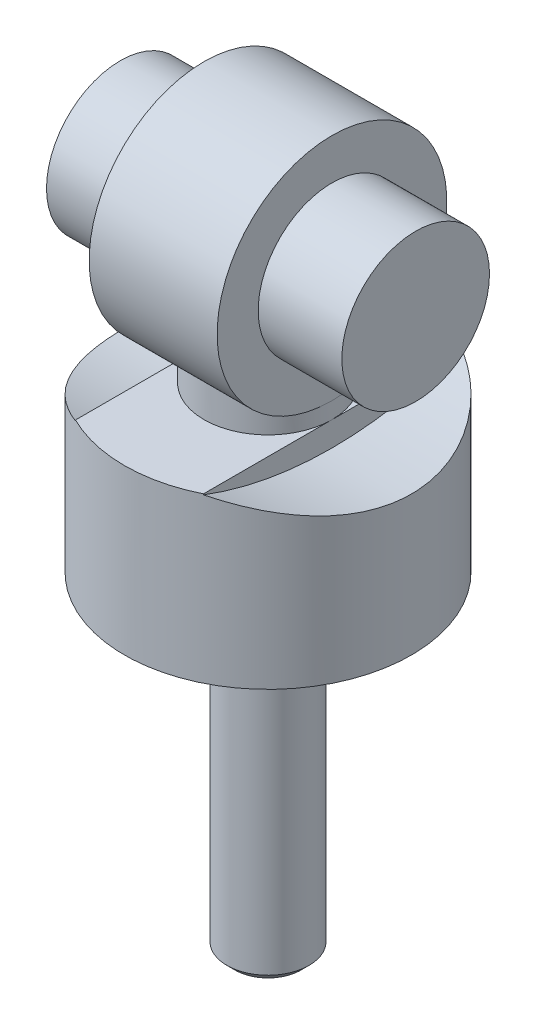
ISO-10303-21;
HEADER;
FILE_DESCRIPTION(('STEP AP214'),'2;1');
FILE_NAME('part.step','',(''),(''),'','','');
FILE_SCHEMA(('AUTOMOTIVE_DESIGN { 1 0 10303 214 1 1 1 1 }'));
ENDSEC;
DATA;
#1=APPLICATION_CONTEXT('core data for automotive mechanical design processes');
#2=APPLICATION_PROTOCOL_DEFINITION('international standard','automotive_design',2000,#1);
#3=PRODUCT_CONTEXT('',#1,'mechanical');
#4=PRODUCT('Part','Part','',(#3));
#5=PRODUCT_RELATED_PRODUCT_CATEGORY('part','',(#4));
#6=PRODUCT_DEFINITION_FORMATION('','',#4);
#7=PRODUCT_DEFINITION_CONTEXT('part definition',#1,'design');
#8=PRODUCT_DEFINITION('design','',#6,#7);
#9=PRODUCT_DEFINITION_SHAPE('','',#8);
#10=(LENGTH_UNIT() NAMED_UNIT(*) SI_UNIT(.MILLI.,.METRE.));
#11=(NAMED_UNIT(*) PLANE_ANGLE_UNIT() SI_UNIT($,.RADIAN.));
#12=(NAMED_UNIT(*) SI_UNIT($,.STERADIAN.) SOLID_ANGLE_UNIT());
#13=UNCERTAINTY_MEASURE_WITH_UNIT(LENGTH_MEASURE(1.E-05),#10,'distance_accuracy_value','');
#14=(GEOMETRIC_REPRESENTATION_CONTEXT(3) GLOBAL_UNCERTAINTY_ASSIGNED_CONTEXT((#13)) GLOBAL_UNIT_ASSIGNED_CONTEXT((#10,
#11,#12)) REPRESENTATION_CONTEXT('',''));
#15=CARTESIAN_POINT('',(0.,0.,0.));
#16=DIRECTION('',(0.,0.,1.));
#17=DIRECTION('',(1.,0.,0.));
#18=AXIS2_PLACEMENT_3D('',#15,#16,#17);
#19=CARTESIAN_POINT('',(0.,-18.,0.));
#20=DIRECTION('',(0.,-1.,0.));
#21=DIRECTION('',(0.,0.,-1.));
#22=AXIS2_PLACEMENT_3D('',#19,#20,#21);
#23=CYLINDRICAL_SURFACE('',#22,8.75);
#24=CARTESIAN_POINT('',(0.,-18.,0.));
#25=DIRECTION('',(0.,-1.,0.));
#26=DIRECTION('',(0.,0.,-1.));
#27=AXIS2_PLACEMENT_3D('',#24,#25,#26);
#28=CIRCLE('',#27,8.75);
#29=CARTESIAN_POINT('',(0.,-18.,-8.75));
#30=VERTEX_POINT('',#29);
#31=EDGE_CURVE('E154',#30,#30,#28,.T.);
#32=ORIENTED_EDGE('',*,*,#31,.F.);
#33=EDGE_LOOP('',(#32));
#34=FACE_BOUND('',#33,.T.);
#35=DIRECTION('',(0.,-1.,0.));
#36=VECTOR('',#35,1.);
#37=CARTESIAN_POINT('',(3.9,-18.,7.83278366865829));
#38=LINE('',#37,#36);
#39=CARTESIAN_POINT('',(3.9,-8.,7.83278366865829));
#40=VERTEX_POINT('',#39);
#41=CARTESIAN_POINT('',(3.9,-8.05467298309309,7.83278366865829));
#42=VERTEX_POINT('',#41);
#43=EDGE_CURVE('E158',#40,#42,#38,.T.);
#44=ORIENTED_EDGE('',*,*,#43,.F.);
#45=CARTESIAN_POINT('',(0.,-8.,0.));
#46=DIRECTION('',(0.,-1.,0.));
#47=DIRECTION('',(0.,0.,-1.));
#48=AXIS2_PLACEMENT_3D('',#45,#46,#47);
#49=CIRCLE('',#48,8.75);
#50=CARTESIAN_POINT('',(-3.9,-8.,7.83278366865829));
#51=VERTEX_POINT('',#50);
#52=EDGE_CURVE('E161',#40,#51,#49,.T.);
#53=ORIENTED_EDGE('',*,*,#52,.T.);
#54=DIRECTION('',(0.,-1.,0.));
#55=VECTOR('',#54,1.);
#56=CARTESIAN_POINT('',(-3.9,-18.,7.83278366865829));
#57=LINE('',#56,#55);
#58=CARTESIAN_POINT('',(-3.9,-8.05467298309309,7.83278366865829));
#59=VERTEX_POINT('',#58);
#60=EDGE_CURVE('E252',#59,#51,#57,.F.);
#61=ORIENTED_EDGE('',*,*,#60,.F.);
#62=CARTESIAN_POINT('',(-3.9,-8.05467298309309,-7.83278366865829));
#63=CARTESIAN_POINT('',(-4.12452384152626,-8.09737217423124,-7.721006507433));
#64=CARTESIAN_POINT('',(-4.34380093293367,-8.1426514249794,-7.5997666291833));
#65=CARTESIAN_POINT('',(-4.77055982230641,-8.23689755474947,-7.33939091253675));
#66=CARTESIAN_POINT('',(-4.97804428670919,-8.28586359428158,-7.20025914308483));
#67=CARTESIAN_POINT('',(-5.38011565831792,-8.38605555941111,-6.90500663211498));
#68=CARTESIAN_POINT('',(-5.57469632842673,-8.43728255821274,-6.74887776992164));
#69=CARTESIAN_POINT('',(-5.94972754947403,-8.54050248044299,-6.42069527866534));
#70=CARTESIAN_POINT('',(-6.13017736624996,-8.59249544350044,-6.24864082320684));
#71=CARTESIAN_POINT('',(-6.4758207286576,-8.69578877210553,-5.88967916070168));
#72=CARTESIAN_POINT('',(-6.64101593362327,-8.74708921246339,-5.7027735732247));
#73=CARTESIAN_POINT('',(-6.95509462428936,-8.8475918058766,-5.31520163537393));
#74=CARTESIAN_POINT('',(-7.10397859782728,-8.89679402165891,-5.11453569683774));
#75=CARTESIAN_POINT('',(-7.3843624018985,-8.99174565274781,-4.70065534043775));
#76=CARTESIAN_POINT('',(-7.51586399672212,-9.03749541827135,-4.4874421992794));
#77=CARTESIAN_POINT('',(-7.76039107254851,-9.12425375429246,-4.04988941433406));
#78=CARTESIAN_POINT('',(-7.87342610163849,-9.16526477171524,-3.82555559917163));
#79=CARTESIAN_POINT('',(-8.07907473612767,-9.24103260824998,-3.36942343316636));
#80=CARTESIAN_POINT('',(-8.17187940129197,-9.2758473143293,-3.13772094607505));
#81=CARTESIAN_POINT('',(-8.33757753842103,-9.33872146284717,-2.66640099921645));
#82=CARTESIAN_POINT('',(-8.41047104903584,-9.36678091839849,-2.42678355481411));
#83=CARTESIAN_POINT('',(-8.5355569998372,-9.41531310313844,-1.94152657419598));
#84=CARTESIAN_POINT('',(-8.58775595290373,-9.43578821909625,-1.69588895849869));
#85=CARTESIAN_POINT('',(-8.67089101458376,-9.46854701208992,-1.2005061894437));
#86=CARTESIAN_POINT('',(-8.70182846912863,-9.48083120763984,-0.950761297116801));
#87=CARTESIAN_POINT('',(-8.7407495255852,-9.49630702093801,-0.4658358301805));
#88=CARTESIAN_POINT('',(-8.750113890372,-9.50004546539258,-0.2307824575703));
#89=CARTESIAN_POINT('',(-8.7498840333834,-9.49995370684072,0.239307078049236));
#90=CARTESIAN_POINT('',(-8.7402907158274,-9.49612386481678,0.474343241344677));
#91=CARTESIAN_POINT('',(-8.70225130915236,-9.48100009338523,0.942599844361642));
#92=CARTESIAN_POINT('',(-8.67380828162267,-9.46970737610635,1.17582057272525));
#93=CARTESIAN_POINT('',(-8.59836743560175,-9.43996057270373,1.63877460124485));
#94=CARTESIAN_POINT('',(-8.55136958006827,-9.42150647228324,1.86850789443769));
#95=CARTESIAN_POINT('',(-8.44061471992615,-9.37843869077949,2.31748063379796));
#96=CARTESIAN_POINT('',(-8.37728079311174,-9.35398116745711,2.53683975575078));
#97=CARTESIAN_POINT('',(-8.23390957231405,-9.29929221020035,2.96937079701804));
#98=CARTESIAN_POINT('',(-8.153866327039,-9.26905871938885,3.18254048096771));
#99=CARTESIAN_POINT('',(-7.9777519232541,-9.20354769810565,3.60132955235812));
#100=CARTESIAN_POINT('',(-7.88168151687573,-9.16827040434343,3.80694929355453));
#101=CARTESIAN_POINT('',(-7.67419463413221,-9.09348021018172,4.2095784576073));
#102=CARTESIAN_POINT('',(-7.56277248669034,-9.05396574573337,4.40658466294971));
#103=CARTESIAN_POINT('',(-7.31951823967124,-8.96958509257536,4.80034457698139));
#104=CARTESIAN_POINT('',(-7.18695156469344,-8.92455123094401,4.99660873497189));
#105=CARTESIAN_POINT('',(-6.90662819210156,-8.83192026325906,5.37744590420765));
#106=CARTESIAN_POINT('',(-6.75886512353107,-8.78432208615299,5.5620139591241));
#107=CARTESIAN_POINT('',(-6.4491916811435,-8.68777999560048,5.91828375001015));
#108=CARTESIAN_POINT('',(-6.28729068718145,-8.63883698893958,6.08999387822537));
#109=CARTESIAN_POINT('',(-5.95018583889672,-8.54078643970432,6.4197690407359));
#110=CARTESIAN_POINT('',(-5.77497970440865,-8.4916788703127,6.5778317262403));
#111=CARTESIAN_POINT('',(-5.33439681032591,-8.37371263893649,6.94407214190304));
#112=CARTESIAN_POINT('',(-5.06252636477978,-8.30539786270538,7.14473831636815));
#113=CARTESIAN_POINT('',(-4.63830883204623,-8.20738306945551,7.42139553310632));
#114=CARTESIAN_POINT('',(-4.49422811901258,-8.17546615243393,7.50952743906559));
#115=CARTESIAN_POINT('',(-4.20090392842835,-8.11353556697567,7.67746300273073));
#116=CARTESIAN_POINT('',(-4.05166060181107,-8.08352184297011,7.7572669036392));
#117=CARTESIAN_POINT('',(-3.9,-8.0546729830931,7.83278366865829));
#118=B_SPLINE_CURVE_WITH_KNOTS('',3,(#62,#63,#64,#65,#66,#67,#68,#69,#70,#71,#72,#73,#74,#75,
#76,#77,#78,#79,#80,#81,#82,#83,#84,#85,#86,#87,#88,#89,#90,#91,#92,#93,#94,#95,#96,#97,#98,#99,
#100,#101,#102,#103,#104,#105,#106,#107,#108,#109,#110,#111,#112,#113,#114,#115,#116,#117),
.UNSPECIFIED.,.F.,.F.,(4,2,2,2,2,2,2,2,2,2,2,2,2,2,2,2,2,2,2,2,2,2,2,2,2,2,2,4),(0.,
0.762954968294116,1.5257367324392,2.28888454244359,3.0520719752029,3.81517629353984,
4.57825778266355,5.34126176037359,6.10386997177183,6.85892977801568,7.61398811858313,
8.36880864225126,9.1235813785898,9.82851622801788,10.5334174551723,11.2382042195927,
11.9429923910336,12.6310960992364,13.3194453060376,14.0077622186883,14.6963340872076,
15.4187923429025,16.14155472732,16.8638411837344,17.5862517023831,18.6179068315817,
19.1333253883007,19.6487288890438),.UNSPECIFIED.);
#119=CARTESIAN_POINT('',(-3.9,-8.05467298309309,-7.83278366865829));
#120=VERTEX_POINT('',#119);
#121=EDGE_CURVE('E109',#120,#59,#118,.T.);
#122=ORIENTED_EDGE('',*,*,#121,.F.);
#123=DIRECTION('',(0.,-1.,0.));
#124=VECTOR('',#123,1.);
#125=CARTESIAN_POINT('',(-3.9,-18.,-7.83278366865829));
#126=LINE('',#125,#124);
#127=CARTESIAN_POINT('',(-3.9,-8.,-7.83278366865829));
#128=VERTEX_POINT('',#127);
#129=EDGE_CURVE('E247',#128,#120,#126,.T.);
#130=ORIENTED_EDGE('',*,*,#129,.F.);
#131=CARTESIAN_POINT('',(3.9,-8.,-7.83278366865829));
#132=VERTEX_POINT('',#131);
#133=EDGE_CURVE('E172',#128,#132,#49,.T.);
#134=ORIENTED_EDGE('',*,*,#133,.T.);
#135=DIRECTION('',(0.,-1.,0.));
#136=VECTOR('',#135,1.);
#137=CARTESIAN_POINT('',(3.9,-18.,-7.83278366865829));
#138=LINE('',#137,#136);
#139=CARTESIAN_POINT('',(3.9,-8.05467298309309,-7.83278366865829));
#140=VERTEX_POINT('',#139);
#141=EDGE_CURVE('E165',#140,#132,#138,.F.);
#142=ORIENTED_EDGE('',*,*,#141,.F.);
#143=CARTESIAN_POINT('',(3.9,-8.05467298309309,7.83278366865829));
#144=CARTESIAN_POINT('',(4.12452384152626,-8.09737217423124,7.721006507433));
#145=CARTESIAN_POINT('',(4.34380093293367,-8.1426514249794,7.5997666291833));
#146=CARTESIAN_POINT('',(4.77055982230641,-8.23689755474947,7.33939091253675));
#147=CARTESIAN_POINT('',(4.97804428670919,-8.28586359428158,7.20025914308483));
#148=CARTESIAN_POINT('',(5.38011565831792,-8.38605555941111,6.90500663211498));
#149=CARTESIAN_POINT('',(5.57469632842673,-8.43728255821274,6.74887776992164));
#150=CARTESIAN_POINT('',(5.94972754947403,-8.54050248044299,6.42069527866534));
#151=CARTESIAN_POINT('',(6.13017736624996,-8.59249544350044,6.24864082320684));
#152=CARTESIAN_POINT('',(6.4758207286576,-8.69578877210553,5.88967916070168));
#153=CARTESIAN_POINT('',(6.64101593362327,-8.74708921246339,5.7027735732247));
#154=CARTESIAN_POINT('',(6.95509462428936,-8.8475918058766,5.31520163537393));
#155=CARTESIAN_POINT('',(7.10397859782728,-8.89679402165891,5.11453569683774));
#156=CARTESIAN_POINT('',(7.3843624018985,-8.99174565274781,4.70065534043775));
#157=CARTESIAN_POINT('',(7.51586399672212,-9.03749541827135,4.4874421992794));
#158=CARTESIAN_POINT('',(7.76039107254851,-9.12425375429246,4.04988941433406));
#159=CARTESIAN_POINT('',(7.87342610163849,-9.16526477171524,3.82555559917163));
#160=CARTESIAN_POINT('',(8.07907473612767,-9.24103260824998,3.36942343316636));
#161=CARTESIAN_POINT('',(8.17187940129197,-9.2758473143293,3.13772094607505));
#162=CARTESIAN_POINT('',(8.33757753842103,-9.33872146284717,2.66640099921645));
#163=CARTESIAN_POINT('',(8.41047104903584,-9.36678091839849,2.42678355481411));
#164=CARTESIAN_POINT('',(8.5355569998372,-9.41531310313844,1.94152657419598));
#165=CARTESIAN_POINT('',(8.58775595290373,-9.43578821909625,1.69588895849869));
#166=CARTESIAN_POINT('',(8.67089101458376,-9.46854701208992,1.2005061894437));
#167=CARTESIAN_POINT('',(8.70182846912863,-9.48083120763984,0.950761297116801));
#168=CARTESIAN_POINT('',(8.7407495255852,-9.49630702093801,0.4658358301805));
#169=CARTESIAN_POINT('',(8.750113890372,-9.50004546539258,0.2307824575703));
#170=CARTESIAN_POINT('',(8.7498840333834,-9.49995370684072,-0.239307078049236));
#171=CARTESIAN_POINT('',(8.7402907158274,-9.49612386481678,-0.474343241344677));
#172=CARTESIAN_POINT('',(8.70225130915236,-9.48100009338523,-0.942599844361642));
#173=CARTESIAN_POINT('',(8.67380828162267,-9.46970737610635,-1.17582057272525));
#174=CARTESIAN_POINT('',(8.59836743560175,-9.43996057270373,-1.63877460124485));
#175=CARTESIAN_POINT('',(8.55136958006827,-9.42150647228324,-1.86850789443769));
#176=CARTESIAN_POINT('',(8.44061471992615,-9.37843869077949,-2.31748063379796));
#177=CARTESIAN_POINT('',(8.37728079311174,-9.35398116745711,-2.53683975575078));
#178=CARTESIAN_POINT('',(8.23390957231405,-9.29929221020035,-2.96937079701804));
#179=CARTESIAN_POINT('',(8.153866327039,-9.26905871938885,-3.18254048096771));
#180=CARTESIAN_POINT('',(7.9777519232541,-9.20354769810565,-3.60132955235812));
#181=CARTESIAN_POINT('',(7.88168151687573,-9.16827040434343,-3.80694929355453));
#182=CARTESIAN_POINT('',(7.67419463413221,-9.09348021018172,-4.2095784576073));
#183=CARTESIAN_POINT('',(7.56277248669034,-9.05396574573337,-4.40658466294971));
#184=CARTESIAN_POINT('',(7.31951823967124,-8.96958509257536,-4.80034457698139));
#185=CARTESIAN_POINT('',(7.18695156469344,-8.92455123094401,-4.99660873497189));
#186=CARTESIAN_POINT('',(6.90662819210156,-8.83192026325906,-5.37744590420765));
#187=CARTESIAN_POINT('',(6.75886512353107,-8.78432208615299,-5.5620139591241));
#188=CARTESIAN_POINT('',(6.4491916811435,-8.68777999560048,-5.91828375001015));
#189=CARTESIAN_POINT('',(6.28729068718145,-8.63883698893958,-6.08999387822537));
#190=CARTESIAN_POINT('',(5.95018583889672,-8.54078643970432,-6.4197690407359));
#191=CARTESIAN_POINT('',(5.77497970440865,-8.4916788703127,-6.5778317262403));
#192=CARTESIAN_POINT('',(5.33439681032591,-8.37371263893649,-6.94407214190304));
#193=CARTESIAN_POINT('',(5.06252636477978,-8.30539786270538,-7.14473831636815));
#194=CARTESIAN_POINT('',(4.63830883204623,-8.20738306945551,-7.42139553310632));
#195=CARTESIAN_POINT('',(4.49422811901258,-8.17546615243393,-7.50952743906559));
#196=CARTESIAN_POINT('',(4.20090392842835,-8.11353556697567,-7.67746300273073));
#197=CARTESIAN_POINT('',(4.05166060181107,-8.08352184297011,-7.7572669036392));
#198=CARTESIAN_POINT('',(3.9,-8.0546729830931,-7.83278366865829));
#199=B_SPLINE_CURVE_WITH_KNOTS('',3,(#143,#144,#145,#146,#147,#148,#149,#150,#151,#152,#153,
#154,#155,#156,#157,#158,#159,#160,#161,#162,#163,#164,#165,#166,#167,#168,#169,#170,#171,#172,
#173,#174,#175,#176,#177,#178,#179,#180,#181,#182,#183,#184,#185,#186,#187,#188,#189,#190,#191,
#192,#193,#194,#195,#196,#197,#198),.UNSPECIFIED.,.F.,.F.,(4,2,2,2,2,2,2,2,2,2,2,2,2,2,2,2,2,2,
2,2,2,2,2,2,2,2,2,4),(0.,0.762954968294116,1.5257367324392,2.28888454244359,3.0520719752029,
3.81517629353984,4.57825778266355,5.34126176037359,6.10386997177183,6.85892977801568,
7.61398811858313,8.36880864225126,9.1235813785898,9.82851622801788,10.5334174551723,
11.2382042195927,11.9429923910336,12.6310960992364,13.3194453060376,14.0077622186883,
14.6963340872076,15.4187923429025,16.14155472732,16.8638411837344,17.5862517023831,
18.6179068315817,19.1333253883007,19.6487288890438),.UNSPECIFIED.);
#200=EDGE_CURVE('E98',#42,#140,#199,.T.);
#201=ORIENTED_EDGE('',*,*,#200,.F.);
#202=EDGE_LOOP('',(#44,#53,#61,#122,#130,#134,#142,#201));
#203=FACE_BOUND('',#202,.T.);
#204=ADVANCED_FACE('F15',(#34,#203),#23,.T.);
#205=CARTESIAN_POINT('',(0.,-8.,-3.9));
#206=DIRECTION('',(0.,-1.,0.));
#207=DIRECTION('',(0.,0.,-1.));
#208=AXIS2_PLACEMENT_3D('',#205,#206,#207);
#209=PLANE('',#208);
#210=DIRECTION('',(0.,0.,1.));
#211=VECTOR('',#210,1.);
#212=CARTESIAN_POINT('',(3.9,-8.,-3.9));
#213=LINE('',#212,#211);
#214=CARTESIAN_POINT('',(3.9,-8.,0.));
#215=VERTEX_POINT('',#214);
#216=EDGE_CURVE('E170',#215,#40,#213,.T.);
#217=ORIENTED_EDGE('',*,*,#216,.F.);
#218=CARTESIAN_POINT('',(0.,-8.,0.));
#219=DIRECTION('',(0.,-1.,0.));
#220=DIRECTION('',(0.,0.,-1.));
#221=AXIS2_PLACEMENT_3D('',#218,#219,#220);
#222=CIRCLE('',#221,3.9);
#223=CARTESIAN_POINT('',(-3.9,-8.,0.));
#224=VERTEX_POINT('',#223);
#225=EDGE_CURVE('E175',#215,#224,#222,.T.);
#226=ORIENTED_EDGE('',*,*,#225,.T.);
#227=DIRECTION('',(0.,0.,-1.));
#228=VECTOR('',#227,1.);
#229=CARTESIAN_POINT('',(-3.9,-8.,-3.9));
#230=LINE('',#229,#228);
#231=EDGE_CURVE('E171',#51,#224,#230,.T.);
#232=ORIENTED_EDGE('',*,*,#231,.F.);
#233=ORIENTED_EDGE('',*,*,#52,.F.);
#234=EDGE_LOOP('',(#217,#226,#232,#233));
#235=FACE_BOUND('',#234,.T.);
#236=ADVANCED_FACE('F144',(#235),#209,.F.);
#237=EDGE_CURVE('E251',#224,#128,#230,.T.);
#238=ORIENTED_EDGE('',*,*,#237,.F.);
#239=EDGE_CURVE('E37',#224,#215,#222,.T.);
#240=ORIENTED_EDGE('',*,*,#239,.T.);
#241=EDGE_CURVE('E260',#132,#215,#213,.T.);
#242=ORIENTED_EDGE('',*,*,#241,.F.);
#243=ORIENTED_EDGE('',*,*,#133,.F.);
#244=EDGE_LOOP('',(#238,#240,#242,#243));
#245=FACE_BOUND('',#244,.T.);
#246=ADVANCED_FACE('F149',(#245),#209,.F.);
#247=CARTESIAN_POINT('',(3.9,0.,0.));
#248=DIRECTION('',(1.,0.,0.));
#249=DIRECTION('',(0.,0.,-1.));
#250=AXIS2_PLACEMENT_3D('',#247,#248,#249);
#251=CYLINDRICAL_SURFACE('',#250,7.);
#252=CARTESIAN_POINT('',(-3.9,-7.,0.));
#253=CARTESIAN_POINT('',(-3.90000031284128,-7.0000002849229,0.101146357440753));
#254=CARTESIAN_POINT('',(-3.89606076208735,-6.99780299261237,0.202288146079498));
#255=CARTESIAN_POINT('',(-3.8803553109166,-6.98907110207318,0.4038084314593));
#256=CARTESIAN_POINT('',(-3.86858664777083,-6.98253497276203,0.504186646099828));
#257=CARTESIAN_POINT('',(-3.83737541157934,-6.96529106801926,0.70335165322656));
#258=CARTESIAN_POINT('',(-3.81793498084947,-6.95458445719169,0.802138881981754));
#259=CARTESIAN_POINT('',(-3.77162646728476,-6.92927102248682,0.997460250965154));
#260=CARTESIAN_POINT('',(-3.74475533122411,-6.91466259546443,1.09399344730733));
#261=CARTESIAN_POINT('',(-3.65367488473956,-6.8656158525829,1.37844239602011));
#262=CARTESIAN_POINT('',(-3.57884423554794,-6.82586770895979,1.56217036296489));
#263=CARTESIAN_POINT('',(-3.40371798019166,-6.73570207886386,1.91400928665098));
#264=CARTESIAN_POINT('',(-3.30341621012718,-6.68528201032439,2.08211644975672));
#265=CARTESIAN_POINT('',(-3.07231715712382,-6.57405157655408,2.41123481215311));
#266=CARTESIAN_POINT('',(-2.93988015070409,-6.51276165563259,2.57093203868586));
#267=CARTESIAN_POINT('',(-2.65187991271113,-6.38792749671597,2.86710248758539));
#268=CARTESIAN_POINT('',(-2.4962931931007,-6.32438101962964,3.00355181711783));
#269=CARTESIAN_POINT('',(-2.14756313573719,-6.19461051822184,3.26342871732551));
#270=CARTESIAN_POINT('',(-1.9522073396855,-6.12877524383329,3.38410558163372));
#271=CARTESIAN_POINT('',(-1.54017690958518,-6.01028349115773,3.59036592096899));
#272=CARTESIAN_POINT('',(-1.32353352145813,-5.95760808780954,3.67599990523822));
#273=CARTESIAN_POINT('',(-0.922013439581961,-5.88301311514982,3.79393677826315));
#274=CARTESIAN_POINT('',(-0.740093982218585,-5.85694711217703,3.83368428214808));
#275=CARTESIAN_POINT('',(-0.370897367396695,-5.82184998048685,3.88678839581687));
#276=CARTESIAN_POINT('',(-0.183625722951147,-5.81280192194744,3.9001712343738));
#277=CARTESIAN_POINT('',(0.191083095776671,-5.81303377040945,3.89982520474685));
#278=CARTESIAN_POINT('',(0.37852022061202,-5.8223342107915,3.8860659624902));
#279=CARTESIAN_POINT('',(0.747931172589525,-5.85794372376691,3.83216617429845));
#280=CARTESIAN_POINT('',(0.92990134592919,-5.88426391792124,3.79200837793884));
#281=CARTESIAN_POINT('',(1.28390008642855,-5.95046957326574,3.68723511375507));
#282=CARTESIAN_POINT('',(1.45593022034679,-5.99035288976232,3.62262351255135));
#283=CARTESIAN_POINT('',(1.78727171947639,-6.07937613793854,3.47115130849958));
#284=CARTESIAN_POINT('',(1.94657809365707,-6.12851967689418,3.3842820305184));
#285=CARTESIAN_POINT('',(2.2737904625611,-6.23962592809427,3.17538598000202));
#286=CARTESIAN_POINT('',(2.43929114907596,-6.30240002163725,3.05001538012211));
#287=CARTESIAN_POINT('',(2.74839589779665,-6.4283539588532,2.77475098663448));
#288=CARTESIAN_POINT('',(2.89198236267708,-6.49153408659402,2.62483768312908));
#289=CARTESIAN_POINT('',(3.16801707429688,-6.61889865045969,2.28605157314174));
#290=CARTESIAN_POINT('',(3.29781181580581,-6.68252127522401,2.09475977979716));
#291=CARTESIAN_POINT('',(3.46646074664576,-6.76786771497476,1.79084562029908));
#292=CARTESIAN_POINT('',(3.51835131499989,-6.79464354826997,1.68666859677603));
#293=CARTESIAN_POINT('',(3.612893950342,-6.84407556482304,1.47329042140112));
#294=CARTESIAN_POINT('',(3.65555155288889,-6.8667342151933,1.36409232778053));
#295=CARTESIAN_POINT('',(3.72840544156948,-6.90580423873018,1.14932095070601));
#296=CARTESIAN_POINT('',(3.75926673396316,-6.92254271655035,1.04403213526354));
#297=CARTESIAN_POINT('',(3.81209300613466,-6.95137123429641,0.830670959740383));
#298=CARTESIAN_POINT('',(3.83406268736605,-6.96346373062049,0.722600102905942));
#299=CARTESIAN_POINT('',(3.868792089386,-6.9826458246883,0.504603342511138));
#300=CARTESIAN_POINT('',(3.88155641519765,-6.9897379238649,0.394678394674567));
#301=CARTESIAN_POINT('',(3.89769038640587,-6.99871019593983,0.173933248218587));
#302=CARTESIAN_POINT('',(3.90106096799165,-7.00059088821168,0.0631131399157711));
#303=CARTESIAN_POINT('',(3.89851220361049,-6.9991712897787,-0.145684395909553));
#304=CARTESIAN_POINT('',(3.8936119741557,-6.99643934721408,-0.243680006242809));
#305=CARTESIAN_POINT('',(3.87646786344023,-6.98691292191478,-0.438858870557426));
#306=CARTESIAN_POINT('',(3.86422167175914,-6.98011716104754,-0.536041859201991));
#307=CARTESIAN_POINT('',(3.8325365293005,-6.96262599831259,-0.728834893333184));
#308=CARTESIAN_POINT('',(3.81310029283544,-6.95193206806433,-0.824445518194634));
#309=CARTESIAN_POINT('',(3.7672642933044,-6.92689811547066,-1.01350789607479));
#310=CARTESIAN_POINT('',(3.7408618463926,-6.91255668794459,-1.10695880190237));
#311=CARTESIAN_POINT('',(3.65188020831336,-6.86467000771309,-1.38231185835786));
#312=CARTESIAN_POINT('',(3.5793522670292,-6.82616282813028,-1.56025439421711));
#313=CARTESIAN_POINT('',(3.41035528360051,-6.73908732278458,-1.90153537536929));
#314=CARTESIAN_POINT('',(3.31387989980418,-6.69051633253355,-2.06486993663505));
#315=CARTESIAN_POINT('',(3.0884274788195,-6.58161394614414,-2.39055758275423));
#316=CARTESIAN_POINT('',(2.95712331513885,-6.52058610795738,-2.5510686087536));
#317=CARTESIAN_POINT('',(2.67130243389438,-6.39603792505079,-2.8490076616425));
#318=CARTESIAN_POINT('',(2.51676008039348,-6.33251488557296,-2.98640983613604));
#319=CARTESIAN_POINT('',(2.17019140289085,-6.20252665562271,-3.24840604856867));
#320=CARTESIAN_POINT('',(1.97595074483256,-6.13642030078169,-3.37027211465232));
#321=CARTESIAN_POINT('',(1.5660225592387,-6.0169979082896,-3.57914696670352));
#322=CARTESIAN_POINT('',(1.35036576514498,-5.96366390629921,-3.66620482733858));
#323=CARTESIAN_POINT('',(0.949863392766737,-5.88745193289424,-3.78707116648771));
#324=CARTESIAN_POINT('',(0.767997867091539,-5.86053840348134,-3.82820584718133));
#325=CARTESIAN_POINT('',(0.398636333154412,-5.82368322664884,-3.88405483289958));
#326=CARTESIAN_POINT('',(0.211146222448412,-5.81372439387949,-3.89879589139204));
#327=CARTESIAN_POINT('',(-0.16431738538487,-5.81220321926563,-3.90106353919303));
#328=CARTESIAN_POINT('',(-0.352291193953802,-5.82066508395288,-3.88855431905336));
#329=CARTESIAN_POINT('',(-0.722985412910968,-5.85478864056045,-3.83697351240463));
#330=CARTESIAN_POINT('',(-0.905702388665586,-5.88046132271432,-3.79788495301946));
#331=CARTESIAN_POINT('',(-1.26056326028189,-5.94547234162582,-3.69526481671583));
#332=CARTESIAN_POINT('',(-1.43274964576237,-5.98475081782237,-3.63184018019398));
#333=CARTESIAN_POINT('',(-1.76456240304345,-6.07272836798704,-3.48273610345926));
#334=CARTESIAN_POINT('',(-1.92418392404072,-6.12143105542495,-3.39704812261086));
#335=CARTESIAN_POINT('',(-2.25197054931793,-6.23169761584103,-3.1908552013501));
#336=CARTESIAN_POINT('',(-2.41778139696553,-6.29409283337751,-3.06704558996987));
#337=CARTESIAN_POINT('',(-2.72777488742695,-6.41955139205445,-2.79497203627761));
#338=CARTESIAN_POINT('',(-2.87193982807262,-6.48261523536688,-2.64668828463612));
#339=CARTESIAN_POINT('',(-3.14998913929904,-6.61026335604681,-2.31081364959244));
#340=CARTESIAN_POINT('',(-3.28116085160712,-6.67429932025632,-2.12072173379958));
#341=CARTESIAN_POINT('',(-3.45204991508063,-6.76049282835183,-1.81846116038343));
#342=CARTESIAN_POINT('',(-3.50471596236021,-6.787588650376,-1.71481303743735));
#343=CARTESIAN_POINT('',(-3.60086999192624,-6.83773159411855,-1.5024293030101));
#344=CARTESIAN_POINT('',(-3.64436349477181,-6.86078114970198,-1.39369680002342));
#345=CARTESIAN_POINT('',(-3.71848344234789,-6.90045090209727,-1.18090483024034));
#346=CARTESIAN_POINT('',(-3.74986495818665,-6.91743981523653,-1.07717625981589));
#347=CARTESIAN_POINT('',(-3.80397740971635,-6.94692221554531,-0.866908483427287));
#348=CARTESIAN_POINT('',(-3.8267128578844,-6.95941804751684,-0.760370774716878));
#349=CARTESIAN_POINT('',(-3.86321922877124,-6.97955808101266,-0.545364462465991));
#350=CARTESIAN_POINT('',(-3.87699416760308,-6.98720445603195,-0.436896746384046));
#351=CARTESIAN_POINT('',(-3.89538409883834,-6.99742510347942,-0.218950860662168));
#352=CARTESIAN_POINT('',(-3.89999966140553,-6.99999969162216,-0.109472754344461));
#353=CARTESIAN_POINT('',(-3.9,-7.,0.));
#354=B_SPLINE_CURVE_WITH_KNOTS('',3,(#252,#253,#254,#255,#256,#257,#258,#259,#260,#261,#262,
#263,#264,#265,#266,#267,#268,#269,#270,#271,#272,#273,#274,#275,#276,#277,#278,#279,#280,#281,
#282,#283,#284,#285,#286,#287,#288,#289,#290,#291,#292,#293,#294,#295,#296,#297,#298,#299,#300,
#301,#302,#303,#304,#305,#306,#307,#308,#309,#310,#311,#312,#313,#314,#315,#316,#317,#318,#319,
#320,#321,#322,#323,#324,#325,#326,#327,#328,#329,#330,#331,#332,#333,#334,#335,#336,#337,#338,
#339,#340,#341,#342,#343,#344,#345,#346,#347,#348,#349,#350,#351,#352,#353),.UNSPECIFIED.,.T.,
.F.,(4,2,2,2,2,2,2,2,2,2,2,2,2,2,2,2,2,2,2,2,2,2,2,2,2,2,2,2,2,2,2,2,2,2,2,2,2,2,2,2,2,2,2,2,2,
2,2,2,2,2,4),(0.,0.303330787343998,0.606768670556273,0.910121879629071,1.21359992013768,
1.81765602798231,2.42185845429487,3.06822728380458,3.71525645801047,4.42832801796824,
5.14036813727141,5.70199096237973,6.26305477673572,6.82474682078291,7.38680627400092,
7.94877689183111,8.51096687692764,9.15905767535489,9.80766618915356,10.5228095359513,
10.8806537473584,11.2382828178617,11.5707819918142,11.903105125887,12.2352618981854,
12.5673855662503,12.8614963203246,13.1556996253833,13.4497919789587,13.7439978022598,
14.3292696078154,14.9146965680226,15.5605601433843,16.2071415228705,16.9195476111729,
17.6309457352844,18.1936677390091,18.7558190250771,19.3187094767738,19.8819597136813,
20.4427626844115,21.0037811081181,21.6495812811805,22.2959067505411,23.0107914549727,
23.3684940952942,23.7259808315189,24.0546214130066,24.383090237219,24.7114117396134,
25.0397128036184),.UNSPECIFIED.);
#355=CARTESIAN_POINT('',(3.9,-7.,0.));
#356=VERTEX_POINT('',#355);
#357=CARTESIAN_POINT('',(-3.9,-7.,0.));
#358=VERTEX_POINT('',#357);
#359=EDGE_CURVE('E187',#356,#358,#354,.T.);
#360=ORIENTED_EDGE('',*,*,#359,.T.);
#361=CARTESIAN_POINT('',(-3.9,0.,0.));
#362=DIRECTION('',(1.,0.,0.));
#363=DIRECTION('',(0.,0.,-1.));
#364=AXIS2_PLACEMENT_3D('',#361,#362,#363);
#365=CIRCLE('',#364,7.);
#366=EDGE_CURVE('E179',#358,#358,#365,.T.);
#367=ORIENTED_EDGE('',*,*,#366,.T.);
#368=EDGE_CURVE('E193',#358,#356,#354,.T.);
#369=ORIENTED_EDGE('',*,*,#368,.T.);
#370=CARTESIAN_POINT('',(3.9,0.,0.));
#371=DIRECTION('',(1.,0.,0.));
#372=DIRECTION('',(0.,0.,-1.));
#373=AXIS2_PLACEMENT_3D('',#370,#371,#372);
#374=CIRCLE('',#373,7.);
#375=EDGE_CURVE('E182',#356,#356,#374,.T.);
#376=ORIENTED_EDGE('',*,*,#375,.F.);
#377=EDGE_LOOP('',(#360,#367,#369,#376));
#378=FACE_BOUND('',#377,.T.);
#379=ADVANCED_FACE('F194',(#378),#251,.T.);
#380=CARTESIAN_POINT('',(-3.9,7.,0.));
#381=DIRECTION('',(-1.,0.,0.));
#382=DIRECTION('',(0.,0.,1.));
#383=AXIS2_PLACEMENT_3D('',#380,#381,#382);
#384=PLANE('',#383);
#385=CARTESIAN_POINT('',(-3.9,0.,0.));
#386=DIRECTION('',(-1.,0.,0.));
#387=DIRECTION('',(0.,0.,1.));
#388=AXIS2_PLACEMENT_3D('',#385,#386,#387);
#389=CIRCLE('',#388,4.5);
#390=CARTESIAN_POINT('',(-3.9,0.,4.5));
#391=VERTEX_POINT('',#390);
#392=EDGE_CURVE('E279',#391,#391,#389,.F.);
#393=ORIENTED_EDGE('',*,*,#392,.T.);
#394=EDGE_LOOP('',(#393));
#395=FACE_BOUND('',#394,.T.);
#396=ORIENTED_EDGE('',*,*,#366,.F.);
#397=EDGE_LOOP('',(#396));
#398=FACE_BOUND('',#397,.T.);
#399=ADVANCED_FACE('F17',(#395,#398),#384,.T.);
#400=CARTESIAN_POINT('',(3.9,4.5,0.));
#401=DIRECTION('',(1.,0.,0.));
#402=DIRECTION('',(0.,0.,-1.));
#403=AXIS2_PLACEMENT_3D('',#400,#401,#402);
#404=PLANE('',#403);
#405=ORIENTED_EDGE('',*,*,#375,.T.);
#406=EDGE_LOOP('',(#405));
#407=FACE_BOUND('',#406,.T.);
#408=CARTESIAN_POINT('',(3.9,0.,0.));
#409=DIRECTION('',(1.,0.,0.));
#410=DIRECTION('',(0.,0.,-1.));
#411=AXIS2_PLACEMENT_3D('',#408,#409,#410);
#412=CIRCLE('',#411,4.5);
#413=CARTESIAN_POINT('',(3.9,0.,-4.5));
#414=VERTEX_POINT('',#413);
#415=EDGE_CURVE('E185',#414,#414,#412,.T.);
#416=ORIENTED_EDGE('',*,*,#415,.F.);
#417=EDGE_LOOP('',(#416));
#418=FACE_BOUND('',#417,.T.);
#419=ADVANCED_FACE('F130',(#407,#418),#404,.T.);
#420=CARTESIAN_POINT('',(0.,-18.,-8.75));
#421=DIRECTION('',(0.,1.,0.));
#422=DIRECTION('',(0.,0.,1.));
#423=AXIS2_PLACEMENT_3D('',#420,#421,#422);
#424=PLANE('',#423);
#425=CARTESIAN_POINT('',(0.,-18.,0.));
#426=DIRECTION('',(0.,-1.,0.));
#427=DIRECTION('',(0.,0.,-1.));
#428=AXIS2_PLACEMENT_3D('',#425,#426,#427);
#429=CIRCLE('',#428,2.5);
#430=CARTESIAN_POINT('',(0.,-18.,-2.5));
#431=VERTEX_POINT('',#430);
#432=EDGE_CURVE('E285',#431,#431,#429,.T.);
#433=ORIENTED_EDGE('',*,*,#432,.F.);
#434=EDGE_LOOP('',(#433));
#435=FACE_BOUND('',#434,.T.);
#436=ORIENTED_EDGE('',*,*,#31,.T.);
#437=EDGE_LOOP('',(#436));
#438=FACE_BOUND('',#437,.T.);
#439=ADVANCED_FACE('F127',(#435,#438),#424,.F.);
#440=CARTESIAN_POINT('',(0.,-18.,0.));
#441=DIRECTION('',(0.,-1.,0.));
#442=DIRECTION('',(0.,0.,-1.));
#443=AXIS2_PLACEMENT_3D('',#440,#441,#442);
#444=CYLINDRICAL_SURFACE('',#443,3.9);
#445=ORIENTED_EDGE('',*,*,#239,.F.);
#446=ORIENTED_EDGE('',*,*,#225,.F.);
#447=EDGE_LOOP('',(#445,#446));
#448=FACE_BOUND('',#447,.T.);
#449=ORIENTED_EDGE('',*,*,#359,.F.);
#450=ORIENTED_EDGE('',*,*,#368,.F.);
#451=EDGE_LOOP('',(#449,#450));
#452=FACE_BOUND('',#451,.T.);
#453=ADVANCED_FACE('F129',(#448,#452),#444,.T.);
#454=CARTESIAN_POINT('',(-3.9,9.4470989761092,0.));
#455=DIRECTION('',(-1.,0.,0.));
#456=DIRECTION('',(0.,0.,1.));
#457=AXIS2_PLACEMENT_3D('',#454,#455,#456);
#458=PLANE('',#457);
#459=ORIENTED_EDGE('',*,*,#129,.T.);
#460=CARTESIAN_POINT('',(-3.9,12.4470989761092,0.));
#461=DIRECTION('',(-1.,0.,0.));
#462=DIRECTION('',(0.,0.,1.));
#463=AXIS2_PLACEMENT_3D('',#460,#461,#462);
#464=CIRCLE('',#463,21.9470989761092);
#465=EDGE_CURVE('E92',#120,#59,#464,.T.);
#466=ORIENTED_EDGE('',*,*,#465,.T.);
#467=ORIENTED_EDGE('',*,*,#60,.T.);
#468=ORIENTED_EDGE('',*,*,#231,.T.);
#469=ORIENTED_EDGE('',*,*,#237,.T.);
#470=EDGE_LOOP('',(#459,#466,#467,#468,#469));
#471=FACE_BOUND('',#470,.T.);
#472=ADVANCED_FACE('F137',(#471),#458,.T.);
#473=CARTESIAN_POINT('',(-17.5,12.4470989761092,0.));
#474=DIRECTION('',(-1.,0.,0.));
#475=DIRECTION('',(0.,0.,1.));
#476=AXIS2_PLACEMENT_3D('',#473,#474,#475);
#477=CYLINDRICAL_SURFACE('',#476,21.9470989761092);
#478=ORIENTED_EDGE('',*,*,#465,.F.);
#479=ORIENTED_EDGE('',*,*,#121,.T.);
#480=EDGE_LOOP('',(#478,#479));
#481=FACE_BOUND('',#480,.T.);
#482=ADVANCED_FACE('F124',(#481),#477,.F.);
#483=CARTESIAN_POINT('',(-17.5,12.4470989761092,0.));
#484=DIRECTION('',(-1.,0.,0.));
#485=DIRECTION('',(0.,0.,1.));
#486=AXIS2_PLACEMENT_3D('',#483,#484,#485);
#487=CYLINDRICAL_SURFACE('',#486,21.9470989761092);
#488=CARTESIAN_POINT('',(3.9,12.4470989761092,0.));
#489=DIRECTION('',(-1.,0.,0.));
#490=DIRECTION('',(0.,0.,1.));
#491=AXIS2_PLACEMENT_3D('',#488,#489,#490);
#492=CIRCLE('',#491,21.9470989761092);
#493=EDGE_CURVE('E254',#140,#42,#492,.T.);
#494=ORIENTED_EDGE('',*,*,#493,.T.);
#495=ORIENTED_EDGE('',*,*,#200,.T.);
#496=EDGE_LOOP('',(#494,#495));
#497=FACE_BOUND('',#496,.T.);
#498=ADVANCED_FACE('F119',(#497),#487,.F.);
#499=CARTESIAN_POINT('',(3.9,-9.5,0.));
#500=DIRECTION('',(1.,0.,0.));
#501=DIRECTION('',(0.,0.,-1.));
#502=AXIS2_PLACEMENT_3D('',#499,#500,#501);
#503=PLANE('',#502);
#504=ORIENTED_EDGE('',*,*,#43,.T.);
#505=ORIENTED_EDGE('',*,*,#493,.F.);
#506=ORIENTED_EDGE('',*,*,#141,.T.);
#507=ORIENTED_EDGE('',*,*,#241,.T.);
#508=ORIENTED_EDGE('',*,*,#216,.T.);
#509=EDGE_LOOP('',(#504,#505,#506,#507,#508));
#510=FACE_BOUND('',#509,.T.);
#511=ADVANCED_FACE('F123',(#510),#503,.T.);
#512=CARTESIAN_POINT('',(9.,0.,0.));
#513=DIRECTION('',(1.,0.,0.));
#514=DIRECTION('',(0.,0.,-1.));
#515=AXIS2_PLACEMENT_3D('',#512,#513,#514);
#516=PLANE('',#515);
#517=CARTESIAN_POINT('',(9.,0.,0.));
#518=DIRECTION('',(1.,0.,0.));
#519=DIRECTION('',(0.,0.,-1.));
#520=AXIS2_PLACEMENT_3D('',#517,#518,#519);
#521=CIRCLE('',#520,4.5);
#522=CARTESIAN_POINT('',(9.,0.,-4.5));
#523=VERTEX_POINT('',#522);
#524=EDGE_CURVE('E277',#523,#523,#521,.T.);
#525=ORIENTED_EDGE('',*,*,#524,.T.);
#526=EDGE_LOOP('',(#525));
#527=FACE_BOUND('',#526,.T.);
#528=ADVANCED_FACE('F274',(#527),#516,.T.);
#529=CARTESIAN_POINT('',(9.,0.,0.));
#530=DIRECTION('',(-1.,0.,0.));
#531=DIRECTION('',(0.,0.,1.));
#532=AXIS2_PLACEMENT_3D('',#529,#530,#531);
#533=CYLINDRICAL_SURFACE('',#532,4.5);
#534=ORIENTED_EDGE('',*,*,#415,.T.);
#535=EDGE_LOOP('',(#534));
#536=FACE_BOUND('',#535,.T.);
#537=ORIENTED_EDGE('',*,*,#524,.F.);
#538=EDGE_LOOP('',(#537));
#539=FACE_BOUND('',#538,.T.);
#540=ADVANCED_FACE('F270',(#536,#539),#533,.T.);
#541=ORIENTED_EDGE('',*,*,#392,.F.);
#542=EDGE_LOOP('',(#541));
#543=FACE_BOUND('',#542,.T.);
#544=CARTESIAN_POINT('',(-9.,0.,0.));
#545=DIRECTION('',(1.,0.,0.));
#546=DIRECTION('',(0.,0.,-1.));
#547=AXIS2_PLACEMENT_3D('',#544,#545,#546);
#548=CIRCLE('',#547,4.5);
#549=CARTESIAN_POINT('',(-9.,0.,-4.5));
#550=VERTEX_POINT('',#549);
#551=EDGE_CURVE('E280',#550,#550,#548,.T.);
#552=ORIENTED_EDGE('',*,*,#551,.T.);
#553=EDGE_LOOP('',(#552));
#554=FACE_BOUND('',#553,.T.);
#555=ADVANCED_FACE('F273',(#543,#554),#533,.T.);
#556=CARTESIAN_POINT('',(-9.,0.,0.));
#557=DIRECTION('',(1.,0.,0.));
#558=DIRECTION('',(0.,0.,-1.));
#559=AXIS2_PLACEMENT_3D('',#556,#557,#558);
#560=PLANE('',#559);
#561=ORIENTED_EDGE('',*,*,#551,.F.);
#562=EDGE_LOOP('',(#561));
#563=FACE_BOUND('',#562,.T.);
#564=ADVANCED_FACE('F318',(#563),#560,.F.);
#565=CARTESIAN_POINT('',(0.,-38.,-2.0095));
#566=DIRECTION('',(0.,1.,0.));
#567=DIRECTION('',(0.,0.,1.));
#568=AXIS2_PLACEMENT_3D('',#565,#566,#567);
#569=PLANE('',#568);
#570=CARTESIAN_POINT('',(0.,-38.,0.));
#571=DIRECTION('',(0.,-1.,0.));
#572=DIRECTION('',(0.,0.,-1.));
#573=AXIS2_PLACEMENT_3D('',#570,#571,#572);
#574=CIRCLE('',#573,2.0095);
#575=CARTESIAN_POINT('',(0.,-38.,-2.0095));
#576=VERTEX_POINT('',#575);
#577=EDGE_CURVE('E293',#576,#576,#574,.T.);
#578=ORIENTED_EDGE('',*,*,#577,.T.);
#579=EDGE_LOOP('',(#578));
#580=FACE_BOUND('',#579,.T.);
#581=ADVANCED_FACE('F297',(#580),#569,.F.);
#582=CARTESIAN_POINT('',(0.,-37.5095,0.));
#583=DIRECTION('',(0.,1.,0.));
#584=DIRECTION('',(0.,0.,1.));
#585=AXIS2_PLACEMENT_3D('',#582,#583,#584);
#586=CONICAL_SURFACE('',#585,2.5,0.78539816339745);
#587=ORIENTED_EDGE('',*,*,#577,.F.);
#588=EDGE_LOOP('',(#587));
#589=FACE_BOUND('',#588,.T.);
#590=CARTESIAN_POINT('',(0.,-37.5095,0.));
#591=DIRECTION('',(0.,-1.,0.));
#592=DIRECTION('',(0.,0.,-1.));
#593=AXIS2_PLACEMENT_3D('',#590,#591,#592);
#594=CIRCLE('',#593,2.5);
#595=CARTESIAN_POINT('',(0.,-37.5095,-2.5));
#596=VERTEX_POINT('',#595);
#597=EDGE_CURVE('E290',#596,#596,#594,.T.);
#598=ORIENTED_EDGE('',*,*,#597,.T.);
#599=EDGE_LOOP('',(#598));
#600=FACE_BOUND('',#599,.T.);
#601=ADVANCED_FACE('F299',(#589,#600),#586,.T.);
#602=CARTESIAN_POINT('',(0.,-38.,0.));
#603=DIRECTION('',(0.,-1.,0.));
#604=DIRECTION('',(0.,0.,-1.));
#605=AXIS2_PLACEMENT_3D('',#602,#603,#604);
#606=CYLINDRICAL_SURFACE('',#605,2.5);
#607=ORIENTED_EDGE('',*,*,#597,.F.);
#608=EDGE_LOOP('',(#607));
#609=FACE_BOUND('',#608,.T.);
#610=ORIENTED_EDGE('',*,*,#432,.T.);
#611=EDGE_LOOP('',(#610));
#612=FACE_BOUND('',#611,.T.);
#613=ADVANCED_FACE('F302',(#609,#612),#606,.T.);
#614=CLOSED_SHELL('',(#204,#236,#246,#379,#399,#419,#439,#453,#472,#482,#498,#511,#528,#540,
#555,#564,#581,#601,#613));
#615=CARTESIAN_POINT('',(0.,-3.30870065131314,-3.05));
#616=CARTESIAN_POINT('',(0.0740543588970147,-3.30870135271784,-3.04999955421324));
#617=CARTESIAN_POINT('',(0.148113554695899,-3.31120079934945,-3.04729547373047));
#618=CARTESIAN_POINT('',(0.29550128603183,-3.32105327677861,-3.03655247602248));
#619=CARTESIAN_POINT('',(0.368829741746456,-3.32840683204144,-3.02851298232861));
#620=CARTESIAN_POINT('',(0.586950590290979,-3.35728100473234,-2.99658701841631));
#621=CARTESIAN_POINT('',(0.729787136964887,-3.385614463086,-2.96489335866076));
#622=CARTESIAN_POINT('',(1.00481607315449,-3.45535402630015,-2.88328172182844));
#623=CARTESIAN_POINT('',(1.13710040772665,-3.49662694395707,-2.83354864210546));
#624=CARTESIAN_POINT('',(1.39123632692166,-3.58733287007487,-2.71780374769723));
#625=CARTESIAN_POINT('',(1.51308617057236,-3.6367672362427,-2.65178922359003));
#626=CARTESIAN_POINT('',(1.76446479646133,-3.74781440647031,-2.49293203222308));
#627=CARTESIAN_POINT('',(1.89204410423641,-3.81010328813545,-2.39747643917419));
#628=CARTESIAN_POINT('',(2.13108358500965,-3.93428541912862,-2.18776550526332));
#629=CARTESIAN_POINT('',(2.24252540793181,-3.99617814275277,-2.07348907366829));
#630=CARTESIAN_POINT('',(2.46301512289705,-4.1236708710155,-1.80832137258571));
#631=CARTESIAN_POINT('',(2.56913328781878,-4.18840811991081,-1.65450535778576));
#632=CARTESIAN_POINT('',(2.70696690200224,-4.27480018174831,-1.40843177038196));
#633=CARTESIAN_POINT('',(2.74934801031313,-4.30180769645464,-1.3238668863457));
#634=CARTESIAN_POINT('',(2.82644155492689,-4.35148238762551,-1.15011183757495));
#635=CARTESIAN_POINT('',(2.86115705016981,-4.37415129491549,-1.06092353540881));
#636=CARTESIAN_POINT('',(2.93723315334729,-4.42421178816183,-0.834029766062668));
#637=CARTESIAN_POINT('',(2.97356864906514,-4.44850916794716,-0.693888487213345));
#638=CARTESIAN_POINT('',(3.02602447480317,-4.48374237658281,-0.408328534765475));
#639=CARTESIAN_POINT('',(3.04216027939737,-4.49468843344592,-0.262913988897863));
#640=CARTESIAN_POINT('',(3.05336718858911,-4.5022807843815,0.0293654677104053));
#641=CARTESIAN_POINT('',(3.04840293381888,-4.49890307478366,0.176232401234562));
#642=CARTESIAN_POINT('',(3.01761506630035,-4.47809945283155,0.466749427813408));
#643=CARTESIAN_POINT('',(2.99178532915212,-4.46066941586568,0.610398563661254));
#644=CARTESIAN_POINT('',(2.92131598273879,-4.41371882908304,0.888013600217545));
#645=CARTESIAN_POINT('',(2.87702540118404,-4.38442289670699,1.02210773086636));
#646=CARTESIAN_POINT('',(2.77159197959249,-4.31597239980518,1.28074304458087));
#647=CARTESIAN_POINT('',(2.71044594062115,-4.27681596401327,1.40528240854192));
#648=CARTESIAN_POINT('',(2.56551457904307,-4.18638203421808,1.65649516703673));
#649=CARTESIAN_POINT('',(2.47995424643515,-4.13423576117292,1.78182668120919));
#650=CARTESIAN_POINT('',(2.29260341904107,-4.02464324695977,2.01721180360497));
#651=CARTESIAN_POINT('',(2.19079412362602,-3.96719089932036,2.12724743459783));
#652=CARTESIAN_POINT('',(1.95420691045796,-3.841187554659,2.34819750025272));
#653=CARTESIAN_POINT('',(1.81676442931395,-3.7723979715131,2.4561343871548));
#654=CARTESIAN_POINT('',(1.52359640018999,-3.64029455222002,2.64798057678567));
#655=CARTESIAN_POINT('',(1.36788117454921,-3.57697765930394,2.7319033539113));
#656=CARTESIAN_POINT('',(1.07873972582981,-3.4781328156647,2.85610629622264));
#657=CARTESIAN_POINT('',(0.948783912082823,-3.43957561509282,2.90201639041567));
#658=CARTESIAN_POINT('',(0.680934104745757,-3.37555318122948,2.97625031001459));
#659=CARTESIAN_POINT('',(0.54305511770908,-3.35006405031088,3.00460625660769));
#660=CARTESIAN_POINT('',(0.261369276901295,-3.31605166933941,3.04212029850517));
#661=CARTESIAN_POINT('',(0.117523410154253,-3.30766771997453,3.05112079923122));
#662=CARTESIAN_POINT('',(-0.169846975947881,-3.30994043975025,3.04865479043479));
#663=CARTESIAN_POINT('',(-0.313371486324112,-3.32059763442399,3.03718771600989));
#664=CARTESIAN_POINT('',(-0.579273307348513,-3.35672225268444,2.99716587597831));
#665=CARTESIAN_POINT('',(-0.702224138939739,-3.3804057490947,2.97065905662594));
#666=CARTESIAN_POINT('',(-0.941707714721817,-3.43813602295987,2.9036484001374));
#667=CARTESIAN_POINT('',(-1.05823445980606,-3.47219229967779,2.86313172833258));
#668=CARTESIAN_POINT('',(-1.33453129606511,-3.56435394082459,2.74826045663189));
#669=CARTESIAN_POINT('',(-1.49008084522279,-3.62637602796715,2.6668870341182));
#670=CARTESIAN_POINT('',(-1.78349065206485,-3.75646016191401,2.48031899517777));
#671=CARTESIAN_POINT('',(-1.9213174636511,-3.82453323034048,2.37508034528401));
#672=CARTESIAN_POINT('',(-2.17938375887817,-3.9604362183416,2.14091948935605));
#673=CARTESIAN_POINT('',(-2.29935531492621,-4.02824992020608,2.01169148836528));
#674=CARTESIAN_POINT('',(-2.51660188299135,-4.1560914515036,1.7321777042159));
#675=CARTESIAN_POINT('',(-2.61391283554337,-4.21613154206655,1.58192588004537));
#676=CARTESIAN_POINT('',(-2.7672445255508,-4.31303677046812,1.2910804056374));
#677=CARTESIAN_POINT('',(-2.82752395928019,-4.35212259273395,1.15347804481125));
#678=CARTESIAN_POINT('',(-2.92771339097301,-4.41786925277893,0.868215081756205));
#679=CARTESIAN_POINT('',(-2.96763645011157,-4.44453805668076,0.720560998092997));
#680=CARTESIAN_POINT('',(-3.02511265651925,-4.48311795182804,0.418279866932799));
#681=CARTESIAN_POINT('',(-3.04255880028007,-4.49495844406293,0.263623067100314));
#682=CARTESIAN_POINT('',(-3.05359112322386,-4.50243250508,-0.0469294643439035));
#683=CARTESIAN_POINT('',(-3.04718207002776,-4.49806931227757,-0.202824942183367));
#684=CARTESIAN_POINT('',(-3.01241336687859,-4.47459437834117,-0.498210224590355));
#685=CARTESIAN_POINT('',(-2.98584821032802,-4.45668871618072,-0.638015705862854));
#686=CARTESIAN_POINT('',(-2.91428327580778,-4.40906289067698,-0.910676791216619));
#687=CARTESIAN_POINT('',(-2.86928056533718,-4.37934084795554,-1.04353128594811));
#688=CARTESIAN_POINT('',(-2.75996758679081,-4.30849145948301,-1.30628099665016));
#689=CARTESIAN_POINT('',(-2.6947819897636,-4.26685537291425,-1.43567105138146));
#690=CARTESIAN_POINT('',(-2.54831500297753,-4.17589690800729,-1.68200981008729));
#691=CARTESIAN_POINT('',(-2.46702497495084,-4.12657040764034,-1.79895178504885));
#692=CARTESIAN_POINT('',(-2.27621742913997,-4.01518689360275,-2.03669083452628));
#693=CARTESIAN_POINT('',(-2.16426874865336,-3.95235046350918,-2.15517053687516));
#694=CARTESIAN_POINT('',(-1.92324507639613,-3.82568072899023,-2.37276837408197));
#695=CARTESIAN_POINT('',(-1.79415533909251,-3.76184660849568,-2.47186965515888));
#696=CARTESIAN_POINT('',(-1.52700320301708,-3.6422101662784,-2.64476720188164));
#697=CARTESIAN_POINT('',(-1.38971103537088,-3.58616592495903,-2.71958017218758));
#698=CARTESIAN_POINT('',(-1.10202420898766,-3.48481309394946,-2.84829695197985));
#699=CARTESIAN_POINT('',(-0.951651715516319,-3.43948680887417,-2.90223532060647));
#700=CARTESIAN_POINT('',(-0.668272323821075,-3.37324804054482,-2.97881254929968));
#701=CARTESIAN_POINT('',(-0.537042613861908,-3.34940288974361,-3.00534763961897));
#702=CARTESIAN_POINT('',(-0.337187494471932,-3.32517436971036,-3.03205239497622));
#703=CARTESIAN_POINT('',(-0.270072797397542,-3.3190214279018,-3.03877098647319));
#704=CARTESIAN_POINT('',(-0.135306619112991,-3.31078493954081,-3.04774423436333));
#705=CARTESIAN_POINT('',(-0.0676553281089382,-3.30870001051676,-3.05000040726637));
#706=CARTESIAN_POINT('',(0.,-3.30870065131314,-3.05));
#707=B_SPLINE_CURVE_WITH_KNOTS('',3,(#615,#616,#617,#618,#619,#620,#621,#622,#623,#624,#625,
#626,#627,#628,#629,#630,#631,#632,#633,#634,#635,#636,#637,#638,#639,#640,#641,#642,#643,#644,
#645,#646,#647,#648,#649,#650,#651,#652,#653,#654,#655,#656,#657,#658,#659,#660,#661,#662,#663,
#664,#665,#666,#667,#668,#669,#670,#671,#672,#673,#674,#675,#676,#677,#678,#679,#680,#681,#682,
#683,#684,#685,#686,#687,#688,#689,#690,#691,#692,#693,#694,#695,#696,#697,#698,#699,#700,#701,
#702,#703,#704,#705,#706),.UNSPECIFIED.,.T.,.F.,(4,2,2,2,2,2,2,2,2,2,2,2,2,2,2,2,2,2,2,2,2,2,2,
2,2,2,2,2,2,2,2,2,2,2,2,2,2,2,2,2,2,2,2,2,2,4),(0.,0.222074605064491,0.444173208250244,
0.888639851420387,1.32867397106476,1.76878136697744,2.28012572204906,2.79204704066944,
3.3816546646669,3.67634407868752,3.97091568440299,4.40924515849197,4.84723863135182,
5.28596638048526,5.72482295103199,6.1557338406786,6.58672656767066,7.06630172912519,
7.54643585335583,8.10749203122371,8.66823277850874,9.09600687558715,9.52299588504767,
9.95344853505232,10.3839130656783,10.7663784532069,11.1491951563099,11.7047959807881,
12.2614304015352,12.8257196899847,13.3891078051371,13.8528597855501,14.3163138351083,
14.7819661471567,15.247525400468,15.6758920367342,16.104326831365,16.5548361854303,
17.0055878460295,17.527655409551,18.0501750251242,18.5465955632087,19.0421906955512,
19.4481632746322,19.6511174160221,19.8540025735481),.UNSPECIFIED.);
#708=CARTESIAN_POINT('',(0.,-3.30870065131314,-3.05));
#709=VERTEX_POINT('',#708);
#710=EDGE_CURVE('E88',#709,#709,#707,.T.);
#711=ORIENTED_EDGE('',*,*,#710,.T.);
#712=EDGE_LOOP('',(#711));
#713=FACE_BOUND('',#712,.T.);
#714=ADVANCED_FACE('F224',(#713),#533,.T.);
#715=CARTESIAN_POINT('',(0.,-18.,0.));
#716=DIRECTION('',(0.,-1.,0.));
#717=DIRECTION('',(0.,0.,-1.));
#718=AXIS2_PLACEMENT_3D('',#715,#716,#717);
#719=CYLINDRICAL_SURFACE('',#718,3.05);
#720=CARTESIAN_POINT('',(0.,-14.,0.));
#721=DIRECTION('',(0.,-1.,0.));
#722=DIRECTION('',(0.,0.,-1.));
#723=AXIS2_PLACEMENT_3D('',#720,#721,#722);
#724=CIRCLE('',#723,3.05);
#725=CARTESIAN_POINT('',(0.,-14.,-3.05));
#726=VERTEX_POINT('',#725);
#727=EDGE_CURVE('E9',#726,#726,#724,.T.);
#728=ORIENTED_EDGE('',*,*,#727,.T.);
#729=EDGE_LOOP('',(#728));
#730=FACE_BOUND('',#729,.T.);
#731=ORIENTED_EDGE('',*,*,#710,.F.);
#732=EDGE_LOOP('',(#731));
#733=FACE_BOUND('',#732,.T.);
#734=ADVANCED_FACE('F218',(#730,#733),#719,.F.);
#735=CARTESIAN_POINT('',(0.,-14.,0.));
#736=DIRECTION('',(0.,-1.,0.));
#737=DIRECTION('',(0.,0.,-1.));
#738=AXIS2_PLACEMENT_3D('',#735,#736,#737);
#739=PLANE('',#738);
#740=ORIENTED_EDGE('',*,*,#727,.F.);
#741=EDGE_LOOP('',(#740));
#742=FACE_BOUND('',#741,.T.);
#743=ADVANCED_FACE('F223',(#742),#739,.F.);
#744=CLOSED_SHELL('',(#714,#734,#743));
#745=CARTESIAN_POINT('',(-2.2477766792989,4.,2.06155281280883));
#746=CARTESIAN_POINT('',(-2.18870941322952,3.96682476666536,2.12593900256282));
#747=CARTESIAN_POINT('',(-2.12705096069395,3.93305483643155,2.18762834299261));
#748=CARTESIAN_POINT('',(-1.99874333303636,3.86516153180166,2.30545762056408));
#749=CARTESIAN_POINT('',(-1.93209122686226,3.83103796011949,2.36159425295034));
#750=CARTESIAN_POINT('',(-1.79343359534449,3.76300806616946,2.46856778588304));
#751=CARTESIAN_POINT('',(-1.72138506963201,3.72910650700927,2.51935210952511));
#752=CARTESIAN_POINT('',(-1.57269548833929,3.66284632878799,2.61475280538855));
#753=CARTESIAN_POINT('',(-1.4960558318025,3.63048724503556,2.65937104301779));
#754=CARTESIAN_POINT('',(-1.28908396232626,3.54899340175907,2.76797473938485));
#755=CARTESIAN_POINT('',(-1.15506092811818,3.50197453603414,2.82669658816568));
#756=CARTESIAN_POINT('',(-0.877003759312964,3.4204011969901,2.9248870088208));
#757=CARTESIAN_POINT('',(-0.733011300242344,3.385798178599,2.96443078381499));
#758=CARTESIAN_POINT('',(-0.460527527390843,3.33833884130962,3.01771031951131));
#759=CARTESIAN_POINT('',(-0.333088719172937,3.32294472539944,3.03449431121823));
#760=CARTESIAN_POINT('',(-0.0761818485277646,3.307100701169,3.05176049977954));
#761=CARTESIAN_POINT('',(0.0532853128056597,3.30664433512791,3.05224974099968));
#762=CARTESIAN_POINT('',(0.310178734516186,3.32073117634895,3.03691226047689));
#763=CARTESIAN_POINT('',(0.437607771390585,3.33525182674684,3.02111007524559));
#764=CARTESIAN_POINT('',(0.687505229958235,3.37711579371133,2.97423152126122));
#765=CARTESIAN_POINT('',(0.809966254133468,3.40447752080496,2.94313321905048));
#766=CARTESIAN_POINT('',(1.08867524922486,3.47979949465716,2.85402192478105));
#767=CARTESIAN_POINT('',(1.24208423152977,3.53160669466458,2.7904336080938));
#768=CARTESIAN_POINT('',(1.53407407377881,3.64453813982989,2.64122776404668));
#769=CARTESIAN_POINT('',(1.67263287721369,3.70567592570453,2.55557809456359));
#770=CARTESIAN_POINT('',(1.88374623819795,3.80670623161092,2.40083120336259));
#771=CARTESIAN_POINT('',(1.96129972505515,3.84579576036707,2.3379039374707));
#772=CARTESIAN_POINT('',(2.10958838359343,3.92351112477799,2.20498836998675));
#773=CARTESIAN_POINT('',(2.180354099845,3.96213827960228,2.13503491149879));
#774=CARTESIAN_POINT('',(2.2477766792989,4.,2.06155281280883));
#775=B_SPLINE_CURVE_WITH_KNOTS('',3,(#745,#746,#747,#748,#749,#750,#751,#752,#753,#754,#755,
#756,#757,#758,#759,#760,#761,#762,#763,#764,#765,#766,#767,#768,#769,#770,#771,#772,#773,#774),
.UNSPECIFIED.,.F.,.F.,(4,2,2,2,2,2,2,2,2,2,2,2,2,2,4),(0.,0.280295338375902,0.560756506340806,
0.843756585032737,1.12667086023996,1.58593250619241,2.04337838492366,2.42998670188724,
2.81642788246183,3.20228789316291,3.58870281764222,4.10781559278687,4.62768900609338,
4.94902769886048,5.26884492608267),.UNSPECIFIED.);
#776=CARTESIAN_POINT('',(-2.2477766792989,4.,2.06155281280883));
#777=VERTEX_POINT('',#776);
#778=CARTESIAN_POINT('',(2.2477766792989,4.,2.06155281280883));
#779=VERTEX_POINT('',#778);
#780=EDGE_CURVE('E93',#777,#779,#775,.T.);
#781=ORIENTED_EDGE('',*,*,#780,.T.);
#782=DIRECTION('',(1.,0.,0.));
#783=VECTOR('',#782,1.);
#784=CARTESIAN_POINT('',(3.9,4.,2.06155281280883));
#785=LINE('',#784,#783);
#786=EDGE_CURVE('E96',#779,#777,#785,.F.);
#787=ORIENTED_EDGE('',*,*,#786,.T.);
#788=EDGE_LOOP('',(#781,#787));
#789=FACE_BOUND('',#788,.T.);
#790=ADVANCED_FACE('F233',(#789),#533,.T.);
#791=CARTESIAN_POINT('',(0.,4.,0.));
#792=DIRECTION('',(0.,-1.,0.));
#793=DIRECTION('',(0.,0.,-1.));
#794=AXIS2_PLACEMENT_3D('',#791,#792,#793);
#795=PLANE('',#794);
#796=CARTESIAN_POINT('',(0.,4.,0.));
#797=DIRECTION('',(0.,-1.,0.));
#798=DIRECTION('',(0.,0.,-1.));
#799=AXIS2_PLACEMENT_3D('',#796,#797,#798);
#800=CIRCLE('',#799,3.05);
#801=EDGE_CURVE('E30',#779,#777,#800,.T.);
#802=ORIENTED_EDGE('',*,*,#801,.T.);
#803=ORIENTED_EDGE('',*,*,#786,.F.);
#804=EDGE_LOOP('',(#802,#803));
#805=FACE_BOUND('',#804,.T.);
#806=ADVANCED_FACE('F229',(#805),#795,.T.);
#807=ORIENTED_EDGE('',*,*,#801,.F.);
#808=ORIENTED_EDGE('',*,*,#780,.F.);
#809=EDGE_LOOP('',(#807,#808));
#810=FACE_BOUND('',#809,.T.);
#811=ADVANCED_FACE('F226',(#810),#719,.F.);
#812=CLOSED_SHELL('',(#790,#806,#811));
#813=CARTESIAN_POINT('',(2.2477766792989,4.,-2.06155281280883));
#814=CARTESIAN_POINT('',(2.18870941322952,3.96682476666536,-2.12593900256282));
#815=CARTESIAN_POINT('',(2.12705096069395,3.93305483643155,-2.18762834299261));
#816=CARTESIAN_POINT('',(1.99874333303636,3.86516153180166,-2.30545762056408));
#817=CARTESIAN_POINT('',(1.93209122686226,3.83103796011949,-2.36159425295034));
#818=CARTESIAN_POINT('',(1.79343359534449,3.76300806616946,-2.46856778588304));
#819=CARTESIAN_POINT('',(1.72138506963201,3.72910650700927,-2.51935210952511));
#820=CARTESIAN_POINT('',(1.57269548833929,3.66284632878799,-2.61475280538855));
#821=CARTESIAN_POINT('',(1.4960558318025,3.63048724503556,-2.65937104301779));
#822=CARTESIAN_POINT('',(1.28908396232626,3.54899340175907,-2.76797473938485));
#823=CARTESIAN_POINT('',(1.15506092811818,3.50197453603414,-2.82669658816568));
#824=CARTESIAN_POINT('',(0.877003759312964,3.4204011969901,-2.9248870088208));
#825=CARTESIAN_POINT('',(0.733011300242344,3.385798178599,-2.96443078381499));
#826=CARTESIAN_POINT('',(0.460527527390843,3.33833884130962,-3.01771031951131));
#827=CARTESIAN_POINT('',(0.333088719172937,3.32294472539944,-3.03449431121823));
#828=CARTESIAN_POINT('',(0.0761818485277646,3.307100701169,-3.05176049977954));
#829=CARTESIAN_POINT('',(-0.0532853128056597,3.30664433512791,-3.05224974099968));
#830=CARTESIAN_POINT('',(-0.310178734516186,3.32073117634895,-3.03691226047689));
#831=CARTESIAN_POINT('',(-0.437607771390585,3.33525182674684,-3.02111007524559));
#832=CARTESIAN_POINT('',(-0.687505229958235,3.37711579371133,-2.97423152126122));
#833=CARTESIAN_POINT('',(-0.809966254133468,3.40447752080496,-2.94313321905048));
#834=CARTESIAN_POINT('',(-1.08867524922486,3.47979949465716,-2.85402192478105));
#835=CARTESIAN_POINT('',(-1.24208423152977,3.53160669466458,-2.7904336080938));
#836=CARTESIAN_POINT('',(-1.53407407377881,3.64453813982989,-2.64122776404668));
#837=CARTESIAN_POINT('',(-1.67263287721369,3.70567592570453,-2.55557809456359));
#838=CARTESIAN_POINT('',(-1.88374623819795,3.80670623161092,-2.40083120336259));
#839=CARTESIAN_POINT('',(-1.96129972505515,3.84579576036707,-2.3379039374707));
#840=CARTESIAN_POINT('',(-2.10958838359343,3.92351112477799,-2.20498836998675));
#841=CARTESIAN_POINT('',(-2.180354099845,3.96213827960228,-2.13503491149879));
#842=CARTESIAN_POINT('',(-2.2477766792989,4.,-2.06155281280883));
#843=B_SPLINE_CURVE_WITH_KNOTS('',3,(#813,#814,#815,#816,#817,#818,#819,#820,#821,#822,#823,
#824,#825,#826,#827,#828,#829,#830,#831,#832,#833,#834,#835,#836,#837,#838,#839,#840,#841,#842),
.UNSPECIFIED.,.F.,.F.,(4,2,2,2,2,2,2,2,2,2,2,2,2,2,4),(0.,0.280295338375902,0.560756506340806,
0.843756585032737,1.12667086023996,1.58593250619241,2.04337838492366,2.42998670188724,
2.81642788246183,3.20228789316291,3.58870281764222,4.10781559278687,4.62768900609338,
4.94902769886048,5.26884492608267),.UNSPECIFIED.);
#844=CARTESIAN_POINT('',(2.2477766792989,4.,-2.06155281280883));
#845=VERTEX_POINT('',#844);
#846=CARTESIAN_POINT('',(-2.24777667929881,4.00000000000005,-2.06155281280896));
#847=VERTEX_POINT('',#846);
#848=EDGE_CURVE('E84',#845,#847,#843,.T.);
#849=ORIENTED_EDGE('',*,*,#848,.T.);
#850=DIRECTION('',(1.,0.,0.));
#851=VECTOR('',#850,1.);
#852=CARTESIAN_POINT('',(3.9,4.,-2.06155281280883));
#853=LINE('',#852,#851);
#854=EDGE_CURVE('E24',#847,#845,#853,.T.);
#855=ORIENTED_EDGE('',*,*,#854,.T.);
#856=EDGE_LOOP('',(#849,#855));
#857=FACE_BOUND('',#856,.T.);
#858=ADVANCED_FACE('F91',(#857),#533,.T.);
#859=EDGE_CURVE('E81',#847,#845,#800,.T.);
#860=ORIENTED_EDGE('',*,*,#859,.F.);
#861=ORIENTED_EDGE('',*,*,#848,.F.);
#862=EDGE_LOOP('',(#860,#861));
#863=FACE_BOUND('',#862,.T.);
#864=ADVANCED_FACE('F83',(#863),#719,.F.);
#865=ORIENTED_EDGE('',*,*,#854,.F.);
#866=ORIENTED_EDGE('',*,*,#859,.T.);
#867=EDGE_LOOP('',(#865,#866));
#868=FACE_BOUND('',#867,.T.);
#869=ADVANCED_FACE('F95',(#868),#795,.T.);
#870=CLOSED_SHELL('',(#858,#864,#869));
#871=ORIENTED_CLOSED_SHELL('',*,#744,.T.);
#872=ORIENTED_CLOSED_SHELL('',*,#812,.T.);
#873=ORIENTED_CLOSED_SHELL('',*,#870,.T.);
#874=BREP_WITH_VOIDS('B1',#614,(#871,#872,#873));
#875=ADVANCED_BREP_SHAPE_REPRESENTATION('',(#18,#874),#14);
#876=SHAPE_DEFINITION_REPRESENTATION(#9,#875);
ENDSEC;
END-ISO-10303-21;
